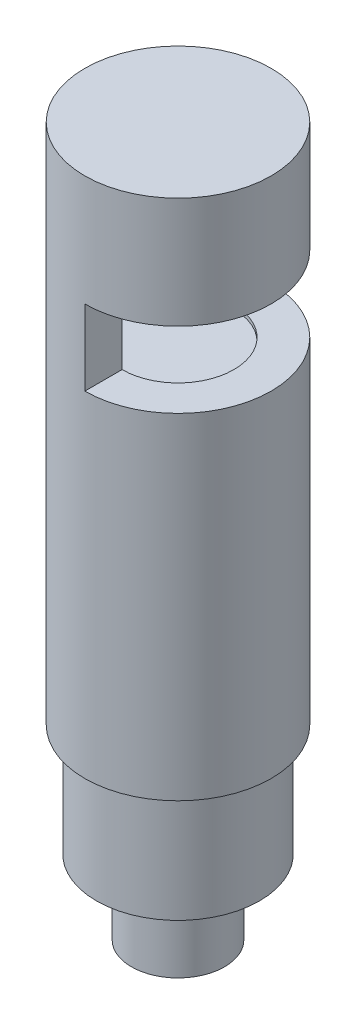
from build123d import *

# Parameters (mm, degrees)
SKETCH1_R               = 6.35
BASE_EXTRUDE_DEPTH      = 35.56
SKETCH2_W               = 6.35
SKETCH2_H               = 5.1435
CUT_EXTRUDE1_DEPTH      = 17.78
CUT_EXTRUDE2_DEPTH      = 5.3975
CUT_EXTRUDE2_DEPTH_BACK = 0.254
SKETCH3_R               = 3.81
SKETCH4_R               = 5.55625
BOSS_EXTRUDE1_DEPTH     = 7.62
SKETCH5_R               = 3.175
BOSS_EXTRUDE2_DEPTH     = 5.08


with BuildPart() as part:
    # Sketch1 → Base-Extrude (new body)
    with BuildSketch(Plane(origin=(0, 0, 0), x_dir=(1, 0, 0), z_dir=(0, 1, 0))):
        with Locations(Location((0, 0, 0), (0, 0, 270))):
            Circle(SKETCH1_R)
    extrude(amount=BASE_EXTRUDE_DEPTH)

    # Sketch2 → Cut-Extrude1 (cut, symmetric)
    with BuildSketch(Plane.XY):
        with Locations((3.175, 25.43175)):
            Rectangle(SKETCH2_W, SKETCH2_H)
    extrude(amount=CUT_EXTRUDE1_DEPTH, both=True, mode=Mode.SUBTRACT)

    # Sketch3 → Cut-Extrude2 (cut, two sides: drawn at the far end of the back side and taken through both)
    with BuildSketch(Plane(origin=(0, 22.86, 0), x_dir=(-1, 0, 0), z_dir=(0, 1, 0)).offset(-CUT_EXTRUDE2_DEPTH_BACK)):
        with Locations(Location((0, 0, 0), (0, 0, 90))):
            Circle(SKETCH3_R)
    extrude(amount=CUT_EXTRUDE2_DEPTH + CUT_EXTRUDE2_DEPTH_BACK, mode=Mode.SUBTRACT)

    # Sketch4 → Boss-Extrude1 (add)
    with BuildSketch(Plane.XZ):
        with Locations(Location((0, 0, 0), (0, 0, 90))):
            Circle(SKETCH4_R)
    extrude(amount=BOSS_EXTRUDE1_DEPTH)

    # Sketch5 → Boss-Extrude2 (add)
    with BuildSketch(Plane.XZ.offset(7.62)):
        with Locations(Location((0, 0, 0), (0, 0, 270))):
            Circle(SKETCH5_R)
    extrude(amount=BOSS_EXTRUDE2_DEPTH)


solid = part.part
